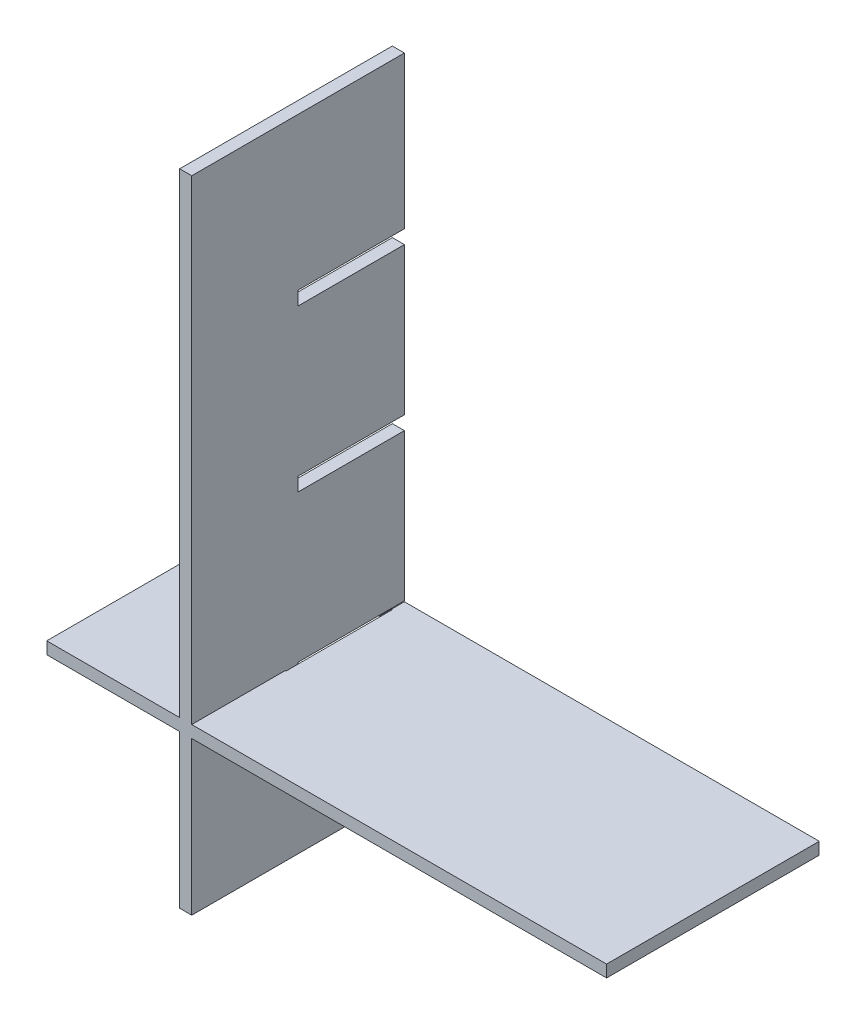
from build123d import *

# Parameters (mm, degrees)
CROQUIS14_W             = 69.5
CROQUIS14_H             = 1.5
SALIENTE_EXTRUIR8_DEPTH = 26.4
CROQUIS17_W             = 1.7
CROQUIS17_H             = 13.2
CORTAR_EXTRUIR1_DEPTH   = 1.5
CROQUIS16_W             = 1.5
CROQUIS16_H             = 79.5
SALIENTE_EXTRUIR9_DEPTH = 26.4
CROQUIS20_W             = 13.2
CROQUIS20_H             = 1.7
CORTAR_EXTRUIR2_DEPTH   = 1.5


with BuildPart() as part:
    # Croquis14 → Saliente-Extruir8 (new body)
    with BuildSketch(Plane.XY):
        with Locations((0, -20)):
            Rectangle(CROQUIS14_W, CROQUIS14_H)
    extrude(amount=SALIENTE_EXTRUIR8_DEPTH)

    # Croquis17 → Cortar-Extruir1 (cut)
    with BuildSketch(Plane.XZ.offset(20.75)):
        with Locations((-17.5, 8.2)):
            Rectangle(CROQUIS17_W, CROQUIS17_H)
    extrude(amount=-CORTAR_EXTRUIR1_DEPTH, mode=Mode.SUBTRACT)

    # Croquis16 → Saliente-Extruir9 (add)
    with BuildSketch(Plane.XY):
        with Locations((-17.5, 0)):
            Rectangle(CROQUIS16_W, CROQUIS16_H)
    extrude(amount=SALIENTE_EXTRUIR9_DEPTH)

    # Croquis20 → Cortar-Extruir2 (cut)
    with BuildSketch(Plane(origin=(-16.75, 0, 0), x_dir=(0, 0, -1), z_dir=(1, 0, 0))):
        with Locations((-6.6, -20)):
            Rectangle(CROQUIS20_W, CROQUIS20_H)
        with Locations((-6.6, 0)):
            Rectangle(CROQUIS20_W, CROQUIS20_H)
        with Locations((-6.6, 20)):
            Rectangle(CROQUIS20_W, CROQUIS20_H)
    extrude(amount=-CORTAR_EXTRUIR2_DEPTH, mode=Mode.SUBTRACT)


solid = part.part
